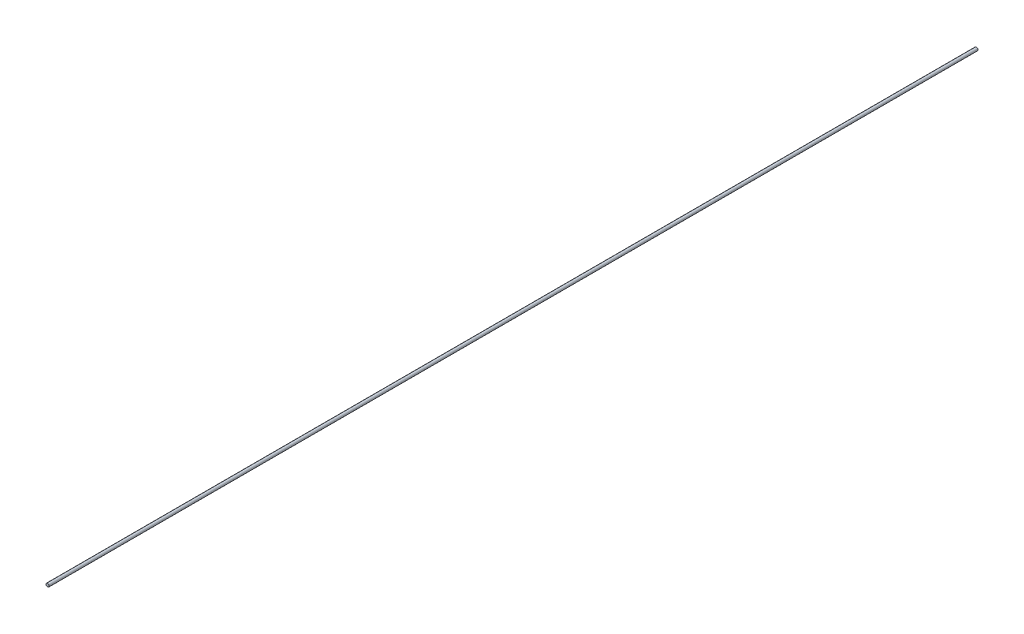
from build123d import *

# Parameters (mm, degrees)
SKETCH1_R          = 1.5875
BASE_EXTRUDE_DEPTH = 914.4


with BuildPart() as part:
    # Sketch1 → Base-Extrude (new body)
    with BuildSketch(Plane.XY):
        Circle(SKETCH1_R)
    extrude(amount=BASE_EXTRUDE_DEPTH)


solid = part.part
